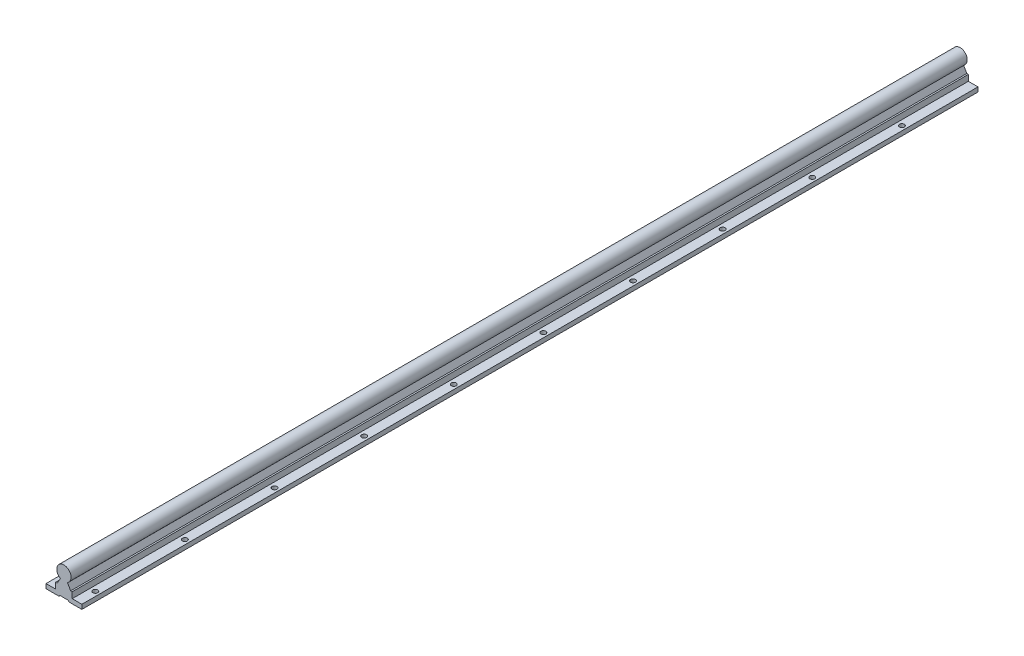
ISO-10303-21;
HEADER;
FILE_DESCRIPTION(('STEP AP214'),'2;1');
FILE_NAME('part.step','',(''),(''),'','','');
FILE_SCHEMA(('AUTOMOTIVE_DESIGN { 1 0 10303 214 1 1 1 1 }'));
ENDSEC;
DATA;
#1=APPLICATION_CONTEXT('core data for automotive mechanical design processes');
#2=APPLICATION_PROTOCOL_DEFINITION('international standard','automotive_design',2000,#1);
#3=PRODUCT_CONTEXT('',#1,'mechanical');
#4=PRODUCT('Part','Part','',(#3));
#5=PRODUCT_RELATED_PRODUCT_CATEGORY('part','',(#4));
#6=PRODUCT_DEFINITION_FORMATION('','',#4);
#7=PRODUCT_DEFINITION_CONTEXT('part definition',#1,'design');
#8=PRODUCT_DEFINITION('design','',#6,#7);
#9=PRODUCT_DEFINITION_SHAPE('','',#8);
#10=(LENGTH_UNIT() NAMED_UNIT(*) SI_UNIT(.MILLI.,.METRE.));
#11=(NAMED_UNIT(*) PLANE_ANGLE_UNIT() SI_UNIT($,.RADIAN.));
#12=(NAMED_UNIT(*) SI_UNIT($,.STERADIAN.) SOLID_ANGLE_UNIT());
#13=UNCERTAINTY_MEASURE_WITH_UNIT(LENGTH_MEASURE(1.E-05),#10,'distance_accuracy_value','');
#14=(GEOMETRIC_REPRESENTATION_CONTEXT(3) GLOBAL_UNCERTAINTY_ASSIGNED_CONTEXT((#13)) GLOBAL_UNIT_ASSIGNED_CONTEXT((#10,
#11,#12)) REPRESENTATION_CONTEXT('',''));
#15=CARTESIAN_POINT('',(0.,0.,0.));
#16=DIRECTION('',(0.,0.,1.));
#17=DIRECTION('',(1.,0.,0.));
#18=AXIS2_PLACEMENT_3D('',#15,#16,#17);
#19=CARTESIAN_POINT('',(-9.25,-11.5,1000.));
#20=DIRECTION('',(0.,-1.,0.));
#21=DIRECTION('',(0.,0.,-1.));
#22=AXIS2_PLACEMENT_3D('',#19,#20,#21);
#23=PLANE('',#22);
#24=CARTESIAN_POINT('',(-15.,-11.5,79.9479983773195));
#25=DIRECTION('',(0.,1.,0.));
#26=DIRECTION('',(0.,0.,1.));
#27=AXIS2_PLACEMENT_3D('',#24,#25,#26);
#28=CIRCLE('',#27,2.75);
#29=CARTESIAN_POINT('',(-15.,-11.5,82.6979983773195));
#30=VERTEX_POINT('',#29);
#31=EDGE_CURVE('E648',#30,#30,#28,.T.);
#32=ORIENTED_EDGE('',*,*,#31,.F.);
#33=EDGE_LOOP('',(#32));
#34=FACE_BOUND('',#33,.T.);
#35=CARTESIAN_POINT('',(-15.,-11.5,379.965332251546));
#36=DIRECTION('',(0.,1.,0.));
#37=DIRECTION('',(0.,0.,1.));
#38=AXIS2_PLACEMENT_3D('',#35,#36,#37);
#39=CIRCLE('',#38,2.75);
#40=CARTESIAN_POINT('',(-15.,-11.5,382.715332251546));
#41=VERTEX_POINT('',#40);
#42=EDGE_CURVE('E624',#41,#41,#39,.T.);
#43=ORIENTED_EDGE('',*,*,#42,.F.);
#44=EDGE_LOOP('',(#43));
#45=FACE_BOUND('',#44,.T.);
#46=CARTESIAN_POINT('',(-15.,-11.5,579.976888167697));
#47=DIRECTION('',(0.,1.,0.));
#48=DIRECTION('',(0.,0.,1.));
#49=AXIS2_PLACEMENT_3D('',#46,#47,#48);
#50=CIRCLE('',#49,2.75);
#51=CARTESIAN_POINT('',(-15.,-11.5,582.726888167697));
#52=VERTEX_POINT('',#51);
#53=EDGE_CURVE('E608',#52,#52,#50,.T.);
#54=ORIENTED_EDGE('',*,*,#53,.F.);
#55=EDGE_LOOP('',(#54));
#56=FACE_BOUND('',#55,.T.);
#57=CARTESIAN_POINT('',(-15.,-11.5,679.982666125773));
#58=DIRECTION('',(0.,1.,0.));
#59=DIRECTION('',(0.,0.,1.));
#60=AXIS2_PLACEMENT_3D('',#57,#58,#59);
#61=CIRCLE('',#60,2.75);
#62=CARTESIAN_POINT('',(-15.,-11.5,682.732666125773));
#63=VERTEX_POINT('',#62);
#64=EDGE_CURVE('E600',#63,#63,#61,.T.);
#65=ORIENTED_EDGE('',*,*,#64,.F.);
#66=EDGE_LOOP('',(#65));
#67=FACE_BOUND('',#66,.T.);
#68=CARTESIAN_POINT('',(-15.,-11.5,779.988444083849));
#69=DIRECTION('',(0.,1.,0.));
#70=DIRECTION('',(0.,0.,1.));
#71=AXIS2_PLACEMENT_3D('',#68,#69,#70);
#72=CIRCLE('',#71,2.75);
#73=CARTESIAN_POINT('',(-15.,-11.5,782.738444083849));
#74=VERTEX_POINT('',#73);
#75=EDGE_CURVE('E592',#74,#74,#72,.T.);
#76=ORIENTED_EDGE('',*,*,#75,.F.);
#77=EDGE_LOOP('',(#76));
#78=FACE_BOUND('',#77,.T.);
#79=CARTESIAN_POINT('',(-15.,-11.5,879.994222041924));
#80=DIRECTION('',(0.,1.,0.));
#81=DIRECTION('',(0.,0.,1.));
#82=AXIS2_PLACEMENT_3D('',#79,#80,#81);
#83=CIRCLE('',#82,2.75);
#84=CARTESIAN_POINT('',(-15.,-11.5,882.744222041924));
#85=VERTEX_POINT('',#84);
#86=EDGE_CURVE('E584',#85,#85,#83,.T.);
#87=ORIENTED_EDGE('',*,*,#86,.F.);
#88=EDGE_LOOP('',(#87));
#89=FACE_BOUND('',#88,.T.);
#90=CARTESIAN_POINT('',(-15.,-11.5,980.));
#91=DIRECTION('',(0.,1.,0.));
#92=DIRECTION('',(0.,0.,1.));
#93=AXIS2_PLACEMENT_3D('',#90,#91,#92);
#94=CIRCLE('',#93,2.75);
#95=CARTESIAN_POINT('',(-15.,-11.5,982.75));
#96=VERTEX_POINT('',#95);
#97=EDGE_CURVE('E522',#96,#96,#94,.T.);
#98=ORIENTED_EDGE('',*,*,#97,.F.);
#99=EDGE_LOOP('',(#98));
#100=FACE_BOUND('',#99,.T.);
#101=DIRECTION('',(-1.,0.,0.));
#102=VECTOR('',#101,1.);
#103=CARTESIAN_POINT('',(-9.25,-11.5,0.));
#104=LINE('',#103,#102);
#105=CARTESIAN_POINT('',(-9.25,-11.5,0.));
#106=VERTEX_POINT('',#105);
#107=CARTESIAN_POINT('',(-20.,-11.5,0.));
#108=VERTEX_POINT('',#107);
#109=EDGE_CURVE('E264',#106,#108,#104,.T.);
#110=ORIENTED_EDGE('',*,*,#109,.T.);
#111=DIRECTION('',(0.,0.,-1.));
#112=VECTOR('',#111,1.);
#113=CARTESIAN_POINT('',(-20.,-11.5,1000.));
#114=LINE('',#113,#112);
#115=CARTESIAN_POINT('',(-20.,-11.5,1000.));
#116=VERTEX_POINT('',#115);
#117=EDGE_CURVE('E290',#116,#108,#114,.T.);
#118=ORIENTED_EDGE('',*,*,#117,.F.);
#119=DIRECTION('',(-1.,0.,0.));
#120=VECTOR('',#119,1.);
#121=CARTESIAN_POINT('',(-9.25,-11.5,1000.));
#122=LINE('',#121,#120);
#123=CARTESIAN_POINT('',(-9.25,-11.5,1000.));
#124=VERTEX_POINT('',#123);
#125=EDGE_CURVE('E386',#124,#116,#122,.T.);
#126=ORIENTED_EDGE('',*,*,#125,.F.);
#127=DIRECTION('',(0.,0.,-1.));
#128=VECTOR('',#127,1.);
#129=CARTESIAN_POINT('',(-9.25,-11.5,1000.));
#130=LINE('',#129,#128);
#131=EDGE_CURVE('E294',#124,#106,#130,.T.);
#132=ORIENTED_EDGE('',*,*,#131,.T.);
#133=EDGE_LOOP('',(#110,#118,#126,#132));
#134=FACE_BOUND('',#133,.T.);
#135=CARTESIAN_POINT('',(-15.,-11.5,479.971110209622));
#136=DIRECTION('',(0.,1.,0.));
#137=DIRECTION('',(0.,0.,1.));
#138=AXIS2_PLACEMENT_3D('',#135,#136,#137);
#139=CIRCLE('',#138,2.75);
#140=CARTESIAN_POINT('',(-15.,-11.5,482.721110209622));
#141=VERTEX_POINT('',#140);
#142=EDGE_CURVE('E616',#141,#141,#139,.T.);
#143=ORIENTED_EDGE('',*,*,#142,.F.);
#144=EDGE_LOOP('',(#143));
#145=FACE_BOUND('',#144,.T.);
#146=CARTESIAN_POINT('',(-15.,-11.5,279.959554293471));
#147=DIRECTION('',(0.,1.,0.));
#148=DIRECTION('',(0.,0.,1.));
#149=AXIS2_PLACEMENT_3D('',#146,#147,#148);
#150=CIRCLE('',#149,2.75);
#151=CARTESIAN_POINT('',(-15.,-11.5,282.709554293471));
#152=VERTEX_POINT('',#151);
#153=EDGE_CURVE('E632',#152,#152,#150,.T.);
#154=ORIENTED_EDGE('',*,*,#153,.F.);
#155=EDGE_LOOP('',(#154));
#156=FACE_BOUND('',#155,.T.);
#157=CARTESIAN_POINT('',(-15.,-11.5,179.953776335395));
#158=DIRECTION('',(0.,1.,0.));
#159=DIRECTION('',(0.,0.,1.));
#160=AXIS2_PLACEMENT_3D('',#157,#158,#159);
#161=CIRCLE('',#160,2.75);
#162=CARTESIAN_POINT('',(-15.,-11.5,182.703776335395));
#163=VERTEX_POINT('',#162);
#164=EDGE_CURVE('E640',#163,#163,#161,.T.);
#165=ORIENTED_EDGE('',*,*,#164,.F.);
#166=EDGE_LOOP('',(#165));
#167=FACE_BOUND('',#166,.T.);
#168=ADVANCED_FACE('F64',(#34,#45,#56,#67,#78,#89,#100,#134,#145,#156,#167),#23,.F.);
#169=CARTESIAN_POINT('',(20.,-11.5,1000.));
#170=DIRECTION('',(0.,-1.,0.));
#171=DIRECTION('',(1.,0.,0.));
#172=AXIS2_PLACEMENT_3D('',#169,#170,#171);
#173=PLANE('',#172);
#174=CARTESIAN_POINT('',(15.,-11.5,79.9479983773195));
#175=DIRECTION('',(0.,1.,0.));
#176=DIRECTION('',(0.,0.,1.));
#177=AXIS2_PLACEMENT_3D('',#174,#175,#176);
#178=CIRCLE('',#177,2.75);
#179=CARTESIAN_POINT('',(15.,-11.5,82.6979983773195));
#180=VERTEX_POINT('',#179);
#181=EDGE_CURVE('E576',#180,#180,#178,.T.);
#182=ORIENTED_EDGE('',*,*,#181,.F.);
#183=EDGE_LOOP('',(#182));
#184=FACE_BOUND('',#183,.T.);
#185=CARTESIAN_POINT('',(15.,-11.5,179.953776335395));
#186=DIRECTION('',(0.,1.,0.));
#187=DIRECTION('',(0.,0.,1.));
#188=AXIS2_PLACEMENT_3D('',#185,#186,#187);
#189=CIRCLE('',#188,2.75);
#190=CARTESIAN_POINT('',(15.,-11.5,182.703776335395));
#191=VERTEX_POINT('',#190);
#192=EDGE_CURVE('E570',#191,#191,#189,.T.);
#193=ORIENTED_EDGE('',*,*,#192,.F.);
#194=EDGE_LOOP('',(#193));
#195=FACE_BOUND('',#194,.T.);
#196=CARTESIAN_POINT('',(15.,-11.5,279.959554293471));
#197=DIRECTION('',(0.,1.,0.));
#198=DIRECTION('',(0.,0.,1.));
#199=AXIS2_PLACEMENT_3D('',#196,#197,#198);
#200=CIRCLE('',#199,2.75);
#201=CARTESIAN_POINT('',(15.,-11.5,282.709554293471));
#202=VERTEX_POINT('',#201);
#203=EDGE_CURVE('E564',#202,#202,#200,.T.);
#204=ORIENTED_EDGE('',*,*,#203,.F.);
#205=EDGE_LOOP('',(#204));
#206=FACE_BOUND('',#205,.T.);
#207=CARTESIAN_POINT('',(15.,-11.5,379.965332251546));
#208=DIRECTION('',(0.,1.,0.));
#209=DIRECTION('',(0.,0.,1.));
#210=AXIS2_PLACEMENT_3D('',#207,#208,#209);
#211=CIRCLE('',#210,2.75);
#212=CARTESIAN_POINT('',(15.,-11.5,382.715332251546));
#213=VERTEX_POINT('',#212);
#214=EDGE_CURVE('E558',#213,#213,#211,.T.);
#215=ORIENTED_EDGE('',*,*,#214,.F.);
#216=EDGE_LOOP('',(#215));
#217=FACE_BOUND('',#216,.T.);
#218=CARTESIAN_POINT('',(15.,-11.5,579.976888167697));
#219=DIRECTION('',(0.,1.,0.));
#220=DIRECTION('',(0.,0.,1.));
#221=AXIS2_PLACEMENT_3D('',#218,#219,#220);
#222=CIRCLE('',#221,2.75);
#223=CARTESIAN_POINT('',(15.,-11.5,582.726888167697));
#224=VERTEX_POINT('',#223);
#225=EDGE_CURVE('E546',#224,#224,#222,.T.);
#226=ORIENTED_EDGE('',*,*,#225,.F.);
#227=EDGE_LOOP('',(#226));
#228=FACE_BOUND('',#227,.T.);
#229=CARTESIAN_POINT('',(15.,-11.5,679.982666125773));
#230=DIRECTION('',(0.,1.,0.));
#231=DIRECTION('',(0.,0.,1.));
#232=AXIS2_PLACEMENT_3D('',#229,#230,#231);
#233=CIRCLE('',#232,2.75);
#234=CARTESIAN_POINT('',(15.,-11.5,682.732666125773));
#235=VERTEX_POINT('',#234);
#236=EDGE_CURVE('E540',#235,#235,#233,.T.);
#237=ORIENTED_EDGE('',*,*,#236,.F.);
#238=EDGE_LOOP('',(#237));
#239=FACE_BOUND('',#238,.T.);
#240=CARTESIAN_POINT('',(15.,-11.5,779.988444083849));
#241=DIRECTION('',(0.,1.,0.));
#242=DIRECTION('',(0.,0.,1.));
#243=AXIS2_PLACEMENT_3D('',#240,#241,#242);
#244=CIRCLE('',#243,2.75);
#245=CARTESIAN_POINT('',(15.,-11.5,782.738444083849));
#246=VERTEX_POINT('',#245);
#247=EDGE_CURVE('E534',#246,#246,#244,.T.);
#248=ORIENTED_EDGE('',*,*,#247,.F.);
#249=EDGE_LOOP('',(#248));
#250=FACE_BOUND('',#249,.T.);
#251=CARTESIAN_POINT('',(15.,-11.5,980.));
#252=DIRECTION('',(0.,1.,0.));
#253=DIRECTION('',(0.,0.,1.));
#254=AXIS2_PLACEMENT_3D('',#251,#252,#253);
#255=CIRCLE('',#254,2.75);
#256=CARTESIAN_POINT('',(15.,-11.5,982.75));
#257=VERTEX_POINT('',#256);
#258=EDGE_CURVE('E507',#257,#257,#255,.T.);
#259=ORIENTED_EDGE('',*,*,#258,.F.);
#260=EDGE_LOOP('',(#259));
#261=FACE_BOUND('',#260,.T.);
#262=DIRECTION('',(-1.,0.,0.));
#263=VECTOR('',#262,1.);
#264=CARTESIAN_POINT('',(20.,-11.5,0.));
#265=LINE('',#264,#263);
#266=CARTESIAN_POINT('',(20.,-11.5,0.));
#267=VERTEX_POINT('',#266);
#268=CARTESIAN_POINT('',(9.25,-11.5,0.));
#269=VERTEX_POINT('',#268);
#270=EDGE_CURVE('E234',#267,#269,#265,.T.);
#271=ORIENTED_EDGE('',*,*,#270,.T.);
#272=DIRECTION('',(0.,0.,-1.));
#273=VECTOR('',#272,1.);
#274=CARTESIAN_POINT('',(9.25,-11.5,1000.));
#275=LINE('',#274,#273);
#276=CARTESIAN_POINT('',(9.25,-11.5,1000.));
#277=VERTEX_POINT('',#276);
#278=EDGE_CURVE('E330',#277,#269,#275,.T.);
#279=ORIENTED_EDGE('',*,*,#278,.F.);
#280=DIRECTION('',(-1.,0.,0.));
#281=VECTOR('',#280,1.);
#282=CARTESIAN_POINT('',(20.,-11.5,1000.));
#283=LINE('',#282,#281);
#284=CARTESIAN_POINT('',(20.,-11.5,1000.));
#285=VERTEX_POINT('',#284);
#286=EDGE_CURVE('E341',#285,#277,#283,.T.);
#287=ORIENTED_EDGE('',*,*,#286,.F.);
#288=DIRECTION('',(0.,0.,-1.));
#289=VECTOR('',#288,1.);
#290=CARTESIAN_POINT('',(20.,-11.5,1000.));
#291=LINE('',#290,#289);
#292=EDGE_CURVE('E74',#285,#267,#291,.T.);
#293=ORIENTED_EDGE('',*,*,#292,.T.);
#294=EDGE_LOOP('',(#271,#279,#287,#293));
#295=FACE_BOUND('',#294,.T.);
#296=CARTESIAN_POINT('',(15.,-11.5,879.994222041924));
#297=DIRECTION('',(0.,1.,0.));
#298=DIRECTION('',(0.,0.,1.));
#299=AXIS2_PLACEMENT_3D('',#296,#297,#298);
#300=CIRCLE('',#299,2.75);
#301=CARTESIAN_POINT('',(15.,-11.5,882.744222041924));
#302=VERTEX_POINT('',#301);
#303=EDGE_CURVE('E528',#302,#302,#300,.T.);
#304=ORIENTED_EDGE('',*,*,#303,.F.);
#305=EDGE_LOOP('',(#304));
#306=FACE_BOUND('',#305,.T.);
#307=CARTESIAN_POINT('',(15.,-11.5,479.971110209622));
#308=DIRECTION('',(0.,1.,0.));
#309=DIRECTION('',(0.,0.,1.));
#310=AXIS2_PLACEMENT_3D('',#307,#308,#309);
#311=CIRCLE('',#310,2.75);
#312=CARTESIAN_POINT('',(15.,-11.5,482.721110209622));
#313=VERTEX_POINT('',#312);
#314=EDGE_CURVE('E552',#313,#313,#311,.T.);
#315=ORIENTED_EDGE('',*,*,#314,.F.);
#316=EDGE_LOOP('',(#315));
#317=FACE_BOUND('',#316,.T.);
#318=ADVANCED_FACE('F338',(#184,#195,#206,#217,#228,#239,#250,#261,#295,#306,#317),#173,.F.);
#319=CARTESIAN_POINT('',(5.47168783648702,-16.5,1000.));
#320=DIRECTION('',(0.,1.,0.));
#321=DIRECTION('',(-1.,0.,0.));
#322=AXIS2_PLACEMENT_3D('',#319,#320,#321);
#323=PLANE('',#322);
#324=CARTESIAN_POINT('',(15.,-16.5,79.9479983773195));
#325=DIRECTION('',(0.,1.,0.));
#326=DIRECTION('',(0.,0.,1.));
#327=AXIS2_PLACEMENT_3D('',#324,#325,#326);
#328=CIRCLE('',#327,2.75);
#329=CARTESIAN_POINT('',(15.,-16.5,82.6979983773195));
#330=VERTEX_POINT('',#329);
#331=EDGE_CURVE('E470',#330,#330,#328,.T.);
#332=ORIENTED_EDGE('',*,*,#331,.T.);
#333=EDGE_LOOP('',(#332));
#334=FACE_BOUND('',#333,.T.);
#335=CARTESIAN_POINT('',(15.,-16.5,179.953776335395));
#336=DIRECTION('',(0.,1.,0.));
#337=DIRECTION('',(0.,0.,1.));
#338=AXIS2_PLACEMENT_3D('',#335,#336,#337);
#339=CIRCLE('',#338,2.75);
#340=CARTESIAN_POINT('',(15.,-16.5,182.703776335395));
#341=VERTEX_POINT('',#340);
#342=EDGE_CURVE('E474',#341,#341,#339,.T.);
#343=ORIENTED_EDGE('',*,*,#342,.T.);
#344=EDGE_LOOP('',(#343));
#345=FACE_BOUND('',#344,.T.);
#346=CARTESIAN_POINT('',(15.,-16.5,279.959554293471));
#347=DIRECTION('',(0.,1.,0.));
#348=DIRECTION('',(0.,0.,1.));
#349=AXIS2_PLACEMENT_3D('',#346,#347,#348);
#350=CIRCLE('',#349,2.75);
#351=CARTESIAN_POINT('',(15.,-16.5,282.709554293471));
#352=VERTEX_POINT('',#351);
#353=EDGE_CURVE('E478',#352,#352,#350,.T.);
#354=ORIENTED_EDGE('',*,*,#353,.T.);
#355=EDGE_LOOP('',(#354));
#356=FACE_BOUND('',#355,.T.);
#357=CARTESIAN_POINT('',(15.,-16.5,379.965332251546));
#358=DIRECTION('',(0.,1.,0.));
#359=DIRECTION('',(0.,0.,1.));
#360=AXIS2_PLACEMENT_3D('',#357,#358,#359);
#361=CIRCLE('',#360,2.75);
#362=CARTESIAN_POINT('',(15.,-16.5,382.715332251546));
#363=VERTEX_POINT('',#362);
#364=EDGE_CURVE('E482',#363,#363,#361,.T.);
#365=ORIENTED_EDGE('',*,*,#364,.T.);
#366=EDGE_LOOP('',(#365));
#367=FACE_BOUND('',#366,.T.);
#368=CARTESIAN_POINT('',(15.,-16.5,479.971110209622));
#369=DIRECTION('',(0.,1.,0.));
#370=DIRECTION('',(0.,0.,1.));
#371=AXIS2_PLACEMENT_3D('',#368,#369,#370);
#372=CIRCLE('',#371,2.75);
#373=CARTESIAN_POINT('',(15.,-16.5,482.721110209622));
#374=VERTEX_POINT('',#373);
#375=EDGE_CURVE('E486',#374,#374,#372,.T.);
#376=ORIENTED_EDGE('',*,*,#375,.T.);
#377=EDGE_LOOP('',(#376));
#378=FACE_BOUND('',#377,.T.);
#379=CARTESIAN_POINT('',(15.,-16.5,579.976888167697));
#380=DIRECTION('',(0.,1.,0.));
#381=DIRECTION('',(0.,0.,1.));
#382=AXIS2_PLACEMENT_3D('',#379,#380,#381);
#383=CIRCLE('',#382,2.75);
#384=CARTESIAN_POINT('',(15.,-16.5,582.726888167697));
#385=VERTEX_POINT('',#384);
#386=EDGE_CURVE('E490',#385,#385,#383,.T.);
#387=ORIENTED_EDGE('',*,*,#386,.T.);
#388=EDGE_LOOP('',(#387));
#389=FACE_BOUND('',#388,.T.);
#390=CARTESIAN_POINT('',(15.,-16.5,679.982666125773));
#391=DIRECTION('',(0.,1.,0.));
#392=DIRECTION('',(0.,0.,1.));
#393=AXIS2_PLACEMENT_3D('',#390,#391,#392);
#394=CIRCLE('',#393,2.75);
#395=CARTESIAN_POINT('',(15.,-16.5,682.732666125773));
#396=VERTEX_POINT('',#395);
#397=EDGE_CURVE('E494',#396,#396,#394,.T.);
#398=ORIENTED_EDGE('',*,*,#397,.T.);
#399=EDGE_LOOP('',(#398));
#400=FACE_BOUND('',#399,.T.);
#401=CARTESIAN_POINT('',(15.,-16.5,779.988444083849));
#402=DIRECTION('',(0.,1.,0.));
#403=DIRECTION('',(0.,0.,1.));
#404=AXIS2_PLACEMENT_3D('',#401,#402,#403);
#405=CIRCLE('',#404,2.75);
#406=CARTESIAN_POINT('',(15.,-16.5,782.738444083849));
#407=VERTEX_POINT('',#406);
#408=EDGE_CURVE('E498',#407,#407,#405,.T.);
#409=ORIENTED_EDGE('',*,*,#408,.T.);
#410=EDGE_LOOP('',(#409));
#411=FACE_BOUND('',#410,.T.);
#412=CARTESIAN_POINT('',(15.,-16.5,879.994222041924));
#413=DIRECTION('',(0.,1.,0.));
#414=DIRECTION('',(0.,0.,1.));
#415=AXIS2_PLACEMENT_3D('',#412,#413,#414);
#416=CIRCLE('',#415,2.75);
#417=CARTESIAN_POINT('',(15.,-16.5,882.744222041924));
#418=VERTEX_POINT('',#417);
#419=EDGE_CURVE('E502',#418,#418,#416,.T.);
#420=ORIENTED_EDGE('',*,*,#419,.T.);
#421=EDGE_LOOP('',(#420));
#422=FACE_BOUND('',#421,.T.);
#423=CARTESIAN_POINT('',(15.,-16.5,980.));
#424=DIRECTION('',(0.,1.,0.));
#425=DIRECTION('',(0.,0.,1.));
#426=AXIS2_PLACEMENT_3D('',#423,#424,#425);
#427=CIRCLE('',#426,2.75);
#428=CARTESIAN_POINT('',(15.,-16.5,982.75));
#429=VERTEX_POINT('',#428);
#430=EDGE_CURVE('E231',#429,#429,#427,.T.);
#431=ORIENTED_EDGE('',*,*,#430,.T.);
#432=EDGE_LOOP('',(#431));
#433=FACE_BOUND('',#432,.T.);
#434=DIRECTION('',(1.,0.,0.));
#435=VECTOR('',#434,1.);
#436=CARTESIAN_POINT('',(5.47168783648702,-16.5,0.));
#437=LINE('',#436,#435);
#438=CARTESIAN_POINT('',(5.47168783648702,-16.5,0.));
#439=VERTEX_POINT('',#438);
#440=CARTESIAN_POINT('',(20.,-16.5,0.));
#441=VERTEX_POINT('',#440);
#442=EDGE_CURVE('E226',#439,#441,#437,.T.);
#443=ORIENTED_EDGE('',*,*,#442,.T.);
#444=DIRECTION('',(0.,0.,-1.));
#445=VECTOR('',#444,1.);
#446=CARTESIAN_POINT('',(20.,-16.5,1000.));
#447=LINE('',#446,#445);
#448=CARTESIAN_POINT('',(20.,-16.5,1000.));
#449=VERTEX_POINT('',#448);
#450=EDGE_CURVE('E12',#449,#441,#447,.T.);
#451=ORIENTED_EDGE('',*,*,#450,.F.);
#452=DIRECTION('',(1.,0.,0.));
#453=VECTOR('',#452,1.);
#454=CARTESIAN_POINT('',(5.47168783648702,-16.5,1000.));
#455=LINE('',#454,#453);
#456=CARTESIAN_POINT('',(5.47168783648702,-16.5,1000.));
#457=VERTEX_POINT('',#456);
#458=EDGE_CURVE('E279',#457,#449,#455,.T.);
#459=ORIENTED_EDGE('',*,*,#458,.F.);
#460=DIRECTION('',(0.,0.,-1.));
#461=VECTOR('',#460,1.);
#462=CARTESIAN_POINT('',(5.47168783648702,-16.5,1000.));
#463=LINE('',#462,#461);
#464=EDGE_CURVE('E222',#457,#439,#463,.T.);
#465=ORIENTED_EDGE('',*,*,#464,.T.);
#466=EDGE_LOOP('',(#443,#451,#459,#465));
#467=FACE_BOUND('',#466,.T.);
#468=ADVANCED_FACE('F66',(#334,#345,#356,#367,#378,#389,#400,#411,#422,#433,#467),#323,.F.);
#469=CARTESIAN_POINT('',(20.,-16.5,1000.));
#470=DIRECTION('',(-1.,0.,0.));
#471=DIRECTION('',(0.,0.,1.));
#472=AXIS2_PLACEMENT_3D('',#469,#470,#471);
#473=PLANE('',#472);
#474=DIRECTION('',(0.,1.,0.));
#475=VECTOR('',#474,1.);
#476=CARTESIAN_POINT('',(20.,-16.5,0.));
#477=LINE('',#476,#475);
#478=EDGE_CURVE('E230',#441,#267,#477,.T.);
#479=ORIENTED_EDGE('',*,*,#478,.T.);
#480=ORIENTED_EDGE('',*,*,#292,.F.);
#481=DIRECTION('',(0.,1.,0.));
#482=VECTOR('',#481,1.);
#483=CARTESIAN_POINT('',(20.,-16.5,1000.));
#484=LINE('',#483,#482);
#485=EDGE_CURVE('E155',#449,#285,#484,.T.);
#486=ORIENTED_EDGE('',*,*,#485,.F.);
#487=ORIENTED_EDGE('',*,*,#450,.T.);
#488=EDGE_LOOP('',(#479,#480,#486,#487));
#489=FACE_BOUND('',#488,.T.);
#490=ADVANCED_FACE('F459',(#489),#473,.F.);
#491=CARTESIAN_POINT('',(9.25,-11.5,1000.));
#492=DIRECTION('',(-1.,0.,0.));
#493=DIRECTION('',(0.,0.,1.));
#494=AXIS2_PLACEMENT_3D('',#491,#492,#493);
#495=PLANE('',#494);
#496=DIRECTION('',(0.,1.,0.));
#497=VECTOR('',#496,1.);
#498=CARTESIAN_POINT('',(9.25,-11.5,0.));
#499=LINE('',#498,#497);
#500=CARTESIAN_POINT('',(9.25,-4.8,0.));
#501=VERTEX_POINT('',#500);
#502=EDGE_CURVE('E237',#269,#501,#499,.T.);
#503=ORIENTED_EDGE('',*,*,#502,.T.);
#504=DIRECTION('',(0.,0.,-1.));
#505=VECTOR('',#504,1.);
#506=CARTESIAN_POINT('',(9.25,-4.8,1000.));
#507=LINE('',#506,#505);
#508=CARTESIAN_POINT('',(9.25,-4.8,1000.));
#509=VERTEX_POINT('',#508);
#510=EDGE_CURVE('E326',#509,#501,#507,.T.);
#511=ORIENTED_EDGE('',*,*,#510,.F.);
#512=DIRECTION('',(0.,1.,0.));
#513=VECTOR('',#512,1.);
#514=CARTESIAN_POINT('',(9.25,-11.5,1000.));
#515=LINE('',#514,#513);
#516=EDGE_CURVE('E360',#277,#509,#515,.T.);
#517=ORIENTED_EDGE('',*,*,#516,.F.);
#518=ORIENTED_EDGE('',*,*,#278,.T.);
#519=EDGE_LOOP('',(#503,#511,#517,#518));
#520=FACE_BOUND('',#519,.T.);
#521=ADVANCED_FACE('F350',(#520),#495,.F.);
#522=CARTESIAN_POINT('',(9.25,-4.8,1000.));
#523=DIRECTION('',(0.,-1.,0.));
#524=DIRECTION('',(1.,0.,0.));
#525=AXIS2_PLACEMENT_3D('',#522,#523,#524);
#526=PLANE('',#525);
#527=DIRECTION('',(-1.,0.,0.));
#528=VECTOR('',#527,1.);
#529=CARTESIAN_POINT('',(9.25,-4.8,0.));
#530=LINE('',#529,#528);
#531=CARTESIAN_POINT('',(7.5218366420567,-4.80000000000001,0.));
#532=VERTEX_POINT('',#531);
#533=EDGE_CURVE('E240',#501,#532,#530,.T.);
#534=ORIENTED_EDGE('',*,*,#533,.T.);
#535=DIRECTION('',(0.,0.,-1.));
#536=VECTOR('',#535,1.);
#537=CARTESIAN_POINT('',(7.5218366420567,-4.80000000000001,1000.));
#538=LINE('',#537,#536);
#539=CARTESIAN_POINT('',(7.5218366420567,-4.80000000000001,1000.));
#540=VERTEX_POINT('',#539);
#541=EDGE_CURVE('E322',#540,#532,#538,.T.);
#542=ORIENTED_EDGE('',*,*,#541,.F.);
#543=DIRECTION('',(-1.,0.,0.));
#544=VECTOR('',#543,1.);
#545=CARTESIAN_POINT('',(9.25,-4.8,1000.));
#546=LINE('',#545,#544);
#547=EDGE_CURVE('E356',#509,#540,#546,.T.);
#548=ORIENTED_EDGE('',*,*,#547,.F.);
#549=ORIENTED_EDGE('',*,*,#510,.T.);
#550=EDGE_LOOP('',(#534,#542,#548,#549));
#551=FACE_BOUND('',#550,.T.);
#552=ADVANCED_FACE('F354',(#551),#526,.F.);
#553=CARTESIAN_POINT('',(7.5218366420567,-4.80000000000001,1000.));
#554=DIRECTION('',(-0.86602540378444,-0.499999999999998,0.));
#555=DIRECTION('',(0.499999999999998,-0.86602540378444,0.));
#556=AXIS2_PLACEMENT_3D('',#553,#554,#555);
#557=PLANE('',#556);
#558=DIRECTION('',(-0.499999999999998,0.86602540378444,0.));
#559=VECTOR('',#558,1.);
#560=CARTESIAN_POINT('',(7.5218366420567,-4.80000000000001,0.));
#561=LINE('',#560,#559);
#562=CARTESIAN_POINT('',(4.,1.3,0.));
#563=VERTEX_POINT('',#562);
#564=EDGE_CURVE('E243',#532,#563,#561,.T.);
#565=ORIENTED_EDGE('',*,*,#564,.T.);
#566=DIRECTION('',(0.,0.,-1.));
#567=VECTOR('',#566,1.);
#568=CARTESIAN_POINT('',(4.,1.3,1000.));
#569=LINE('',#568,#567);
#570=CARTESIAN_POINT('',(4.,1.3,1000.));
#571=VERTEX_POINT('',#570);
#572=EDGE_CURVE('E318',#571,#563,#569,.T.);
#573=ORIENTED_EDGE('',*,*,#572,.F.);
#574=DIRECTION('',(-0.499999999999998,0.86602540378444,0.));
#575=VECTOR('',#574,1.);
#576=CARTESIAN_POINT('',(7.5218366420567,-4.80000000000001,1000.));
#577=LINE('',#576,#575);
#578=EDGE_CURVE('E359',#540,#571,#577,.T.);
#579=ORIENTED_EDGE('',*,*,#578,.F.);
#580=ORIENTED_EDGE('',*,*,#541,.T.);
#581=EDGE_LOOP('',(#565,#573,#579,#580));
#582=FACE_BOUND('',#581,.T.);
#583=ADVANCED_FACE('F451',(#582),#557,.F.);
#584=CARTESIAN_POINT('',(4.,1.3,1000.));
#585=DIRECTION('',(0.,-1.,0.));
#586=DIRECTION('',(1.,0.,0.));
#587=AXIS2_PLACEMENT_3D('',#584,#585,#586);
#588=PLANE('',#587);
#589=DIRECTION('',(-1.,0.,0.));
#590=VECTOR('',#589,1.);
#591=CARTESIAN_POINT('',(4.,1.3,0.));
#592=LINE('',#591,#590);
#593=CARTESIAN_POINT('',(3.48711915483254,1.3,0.));
#594=VERTEX_POINT('',#593);
#595=EDGE_CURVE('E246',#563,#594,#592,.T.);
#596=ORIENTED_EDGE('',*,*,#595,.T.);
#597=DIRECTION('',(0.,0.,-1.));
#598=VECTOR('',#597,1.);
#599=CARTESIAN_POINT('',(3.48711915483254,1.3,1000.));
#600=LINE('',#599,#598);
#601=CARTESIAN_POINT('',(3.48711915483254,1.3,1000.));
#602=VERTEX_POINT('',#601);
#603=EDGE_CURVE('E314',#602,#594,#600,.T.);
#604=ORIENTED_EDGE('',*,*,#603,.F.);
#605=DIRECTION('',(-1.,0.,0.));
#606=VECTOR('',#605,1.);
#607=CARTESIAN_POINT('',(4.,1.3,1000.));
#608=LINE('',#607,#606);
#609=EDGE_CURVE('E364',#571,#602,#608,.T.);
#610=ORIENTED_EDGE('',*,*,#609,.F.);
#611=ORIENTED_EDGE('',*,*,#572,.T.);
#612=EDGE_LOOP('',(#596,#604,#610,#611));
#613=FACE_BOUND('',#612,.T.);
#614=ADVANCED_FACE('F447',(#613),#588,.F.);
#615=CARTESIAN_POINT('',(0.,8.5,1000.));
#616=DIRECTION('',(0.,0.,-1.));
#617=DIRECTION('',(-1.,0.,0.));
#618=AXIS2_PLACEMENT_3D('',#615,#616,#617);
#619=CYLINDRICAL_SURFACE('',#618,8.);
#620=CARTESIAN_POINT('',(0.,8.5,0.));
#621=DIRECTION('',(0.,0.,1.));
#622=DIRECTION('',(1.,0.,0.));
#623=AXIS2_PLACEMENT_3D('',#620,#621,#622);
#624=CIRCLE('',#623,8.);
#625=CARTESIAN_POINT('',(-3.48711915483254,1.3,0.));
#626=VERTEX_POINT('',#625);
#627=EDGE_CURVE('E249',#594,#626,#624,.T.);
#628=ORIENTED_EDGE('',*,*,#627,.T.);
#629=DIRECTION('',(0.,0.,-1.));
#630=VECTOR('',#629,1.);
#631=CARTESIAN_POINT('',(-3.48711915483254,1.3,1000.));
#632=LINE('',#631,#630);
#633=CARTESIAN_POINT('',(-3.48711915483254,1.3,1000.));
#634=VERTEX_POINT('',#633);
#635=EDGE_CURVE('E310',#634,#626,#632,.T.);
#636=ORIENTED_EDGE('',*,*,#635,.F.);
#637=CARTESIAN_POINT('',(0.,8.5,1000.));
#638=DIRECTION('',(0.,0.,1.));
#639=DIRECTION('',(1.,0.,0.));
#640=AXIS2_PLACEMENT_3D('',#637,#638,#639);
#641=CIRCLE('',#640,8.);
#642=EDGE_CURVE('E371',#602,#634,#641,.T.);
#643=ORIENTED_EDGE('',*,*,#642,.F.);
#644=ORIENTED_EDGE('',*,*,#603,.T.);
#645=EDGE_LOOP('',(#628,#636,#643,#644));
#646=FACE_BOUND('',#645,.T.);
#647=ADVANCED_FACE('F443',(#646),#619,.T.);
#648=CARTESIAN_POINT('',(-3.48711915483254,1.3,1000.));
#649=DIRECTION('',(0.,-1.,0.));
#650=DIRECTION('',(0.,0.,-1.));
#651=AXIS2_PLACEMENT_3D('',#648,#649,#650);
#652=PLANE('',#651);
#653=DIRECTION('',(-1.,0.,0.));
#654=VECTOR('',#653,1.);
#655=CARTESIAN_POINT('',(-3.48711915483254,1.3,0.));
#656=LINE('',#655,#654);
#657=CARTESIAN_POINT('',(-4.,1.3,0.));
#658=VERTEX_POINT('',#657);
#659=EDGE_CURVE('E252',#626,#658,#656,.T.);
#660=ORIENTED_EDGE('',*,*,#659,.T.);
#661=DIRECTION('',(0.,0.,-1.));
#662=VECTOR('',#661,1.);
#663=CARTESIAN_POINT('',(-4.,1.3,1000.));
#664=LINE('',#663,#662);
#665=CARTESIAN_POINT('',(-4.,1.3,1000.));
#666=VERTEX_POINT('',#665);
#667=EDGE_CURVE('E306',#666,#658,#664,.T.);
#668=ORIENTED_EDGE('',*,*,#667,.F.);
#669=DIRECTION('',(-1.,0.,0.));
#670=VECTOR('',#669,1.);
#671=CARTESIAN_POINT('',(-3.48711915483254,1.3,1000.));
#672=LINE('',#671,#670);
#673=EDGE_CURVE('E374',#634,#666,#672,.T.);
#674=ORIENTED_EDGE('',*,*,#673,.F.);
#675=ORIENTED_EDGE('',*,*,#635,.T.);
#676=EDGE_LOOP('',(#660,#668,#674,#675));
#677=FACE_BOUND('',#676,.T.);
#678=ADVANCED_FACE('F439',(#677),#652,.F.);
#679=CARTESIAN_POINT('',(-4.,1.3,1000.));
#680=DIRECTION('',(0.86602540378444,-0.499999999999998,0.));
#681=DIRECTION('',(0.499999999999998,0.86602540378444,0.));
#682=AXIS2_PLACEMENT_3D('',#679,#680,#681);
#683=PLANE('',#682);
#684=DIRECTION('',(-0.499999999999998,-0.86602540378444,0.));
#685=VECTOR('',#684,1.);
#686=CARTESIAN_POINT('',(-4.,1.3,0.));
#687=LINE('',#686,#685);
#688=CARTESIAN_POINT('',(-7.5218366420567,-4.8,0.));
#689=VERTEX_POINT('',#688);
#690=EDGE_CURVE('E255',#658,#689,#687,.T.);
#691=ORIENTED_EDGE('',*,*,#690,.T.);
#692=DIRECTION('',(0.,0.,-1.));
#693=VECTOR('',#692,1.);
#694=CARTESIAN_POINT('',(-7.5218366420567,-4.8,1000.));
#695=LINE('',#694,#693);
#696=CARTESIAN_POINT('',(-7.5218366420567,-4.8,1000.));
#697=VERTEX_POINT('',#696);
#698=EDGE_CURVE('E302',#697,#689,#695,.T.);
#699=ORIENTED_EDGE('',*,*,#698,.F.);
#700=DIRECTION('',(-0.499999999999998,-0.86602540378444,0.));
#701=VECTOR('',#700,1.);
#702=CARTESIAN_POINT('',(-4.,1.3,1000.));
#703=LINE('',#702,#701);
#704=EDGE_CURVE('E377',#666,#697,#703,.T.);
#705=ORIENTED_EDGE('',*,*,#704,.F.);
#706=ORIENTED_EDGE('',*,*,#667,.T.);
#707=EDGE_LOOP('',(#691,#699,#705,#706));
#708=FACE_BOUND('',#707,.T.);
#709=ADVANCED_FACE('F435',(#708),#683,.F.);
#710=CARTESIAN_POINT('',(-7.5218366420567,-4.8,1000.));
#711=DIRECTION('',(0.,-1.,0.));
#712=DIRECTION('',(0.,0.,-1.));
#713=AXIS2_PLACEMENT_3D('',#710,#711,#712);
#714=PLANE('',#713);
#715=DIRECTION('',(-1.,0.,0.));
#716=VECTOR('',#715,1.);
#717=CARTESIAN_POINT('',(-7.5218366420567,-4.8,0.));
#718=LINE('',#717,#716);
#719=CARTESIAN_POINT('',(-9.25,-4.8,0.));
#720=VERTEX_POINT('',#719);
#721=EDGE_CURVE('E258',#689,#720,#718,.T.);
#722=ORIENTED_EDGE('',*,*,#721,.T.);
#723=DIRECTION('',(0.,0.,-1.));
#724=VECTOR('',#723,1.);
#725=CARTESIAN_POINT('',(-9.25,-4.8,1000.));
#726=LINE('',#725,#724);
#727=CARTESIAN_POINT('',(-9.25,-4.8,1000.));
#728=VERTEX_POINT('',#727);
#729=EDGE_CURVE('E298',#728,#720,#726,.T.);
#730=ORIENTED_EDGE('',*,*,#729,.F.);
#731=DIRECTION('',(-1.,0.,0.));
#732=VECTOR('',#731,1.);
#733=CARTESIAN_POINT('',(-7.5218366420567,-4.8,1000.));
#734=LINE('',#733,#732);
#735=EDGE_CURVE('E380',#697,#728,#734,.T.);
#736=ORIENTED_EDGE('',*,*,#735,.F.);
#737=ORIENTED_EDGE('',*,*,#698,.T.);
#738=EDGE_LOOP('',(#722,#730,#736,#737));
#739=FACE_BOUND('',#738,.T.);
#740=ADVANCED_FACE('F431',(#739),#714,.F.);
#741=CARTESIAN_POINT('',(-9.25,-4.8,1000.));
#742=DIRECTION('',(1.,0.,0.));
#743=DIRECTION('',(0.,0.,-1.));
#744=AXIS2_PLACEMENT_3D('',#741,#742,#743);
#745=PLANE('',#744);
#746=DIRECTION('',(0.,-1.,0.));
#747=VECTOR('',#746,1.);
#748=CARTESIAN_POINT('',(-9.25,-4.8,0.));
#749=LINE('',#748,#747);
#750=EDGE_CURVE('E261',#720,#106,#749,.T.);
#751=ORIENTED_EDGE('',*,*,#750,.T.);
#752=ORIENTED_EDGE('',*,*,#131,.F.);
#753=DIRECTION('',(0.,-1.,0.));
#754=VECTOR('',#753,1.);
#755=CARTESIAN_POINT('',(-9.25,-4.8,1000.));
#756=LINE('',#755,#754);
#757=EDGE_CURVE('E383',#728,#124,#756,.T.);
#758=ORIENTED_EDGE('',*,*,#757,.F.);
#759=ORIENTED_EDGE('',*,*,#729,.T.);
#760=EDGE_LOOP('',(#751,#752,#758,#759));
#761=FACE_BOUND('',#760,.T.);
#762=ADVANCED_FACE('F428',(#761),#745,.F.);
#763=CARTESIAN_POINT('',(-20.,-11.5,1000.));
#764=DIRECTION('',(1.,0.,0.));
#765=DIRECTION('',(0.,0.,-1.));
#766=AXIS2_PLACEMENT_3D('',#763,#764,#765);
#767=PLANE('',#766);
#768=DIRECTION('',(0.,-1.,0.));
#769=VECTOR('',#768,1.);
#770=CARTESIAN_POINT('',(-20.,-11.5,0.));
#771=LINE('',#770,#769);
#772=CARTESIAN_POINT('',(-20.,-16.5,0.));
#773=VERTEX_POINT('',#772);
#774=EDGE_CURVE('E267',#108,#773,#771,.T.);
#775=ORIENTED_EDGE('',*,*,#774,.T.);
#776=DIRECTION('',(0.,0.,-1.));
#777=VECTOR('',#776,1.);
#778=CARTESIAN_POINT('',(-20.,-16.5,1000.));
#779=LINE('',#778,#777);
#780=CARTESIAN_POINT('',(-20.,-16.5,1000.));
#781=VERTEX_POINT('',#780);
#782=EDGE_CURVE('E286',#781,#773,#779,.T.);
#783=ORIENTED_EDGE('',*,*,#782,.F.);
#784=DIRECTION('',(0.,-1.,0.));
#785=VECTOR('',#784,1.);
#786=CARTESIAN_POINT('',(-20.,-11.5,1000.));
#787=LINE('',#786,#785);
#788=EDGE_CURVE('E389',#116,#781,#787,.T.);
#789=ORIENTED_EDGE('',*,*,#788,.F.);
#790=ORIENTED_EDGE('',*,*,#117,.T.);
#791=EDGE_LOOP('',(#775,#783,#789,#790));
#792=FACE_BOUND('',#791,.T.);
#793=ADVANCED_FACE('F397',(#792),#767,.F.);
#794=CARTESIAN_POINT('',(-20.,-16.5,1000.));
#795=DIRECTION('',(0.,1.,0.));
#796=DIRECTION('',(-1.,0.,0.));
#797=AXIS2_PLACEMENT_3D('',#794,#795,#796);
#798=PLANE('',#797);
#799=CARTESIAN_POINT('',(-15.,-16.5,79.9479983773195));
#800=DIRECTION('',(0.,1.,0.));
#801=DIRECTION('',(0.,0.,1.));
#802=AXIS2_PLACEMENT_3D('',#799,#800,#801);
#803=CIRCLE('',#802,2.75);
#804=CARTESIAN_POINT('',(-15.,-16.5,82.6979983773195));
#805=VERTEX_POINT('',#804);
#806=EDGE_CURVE('E644',#805,#805,#803,.T.);
#807=ORIENTED_EDGE('',*,*,#806,.T.);
#808=EDGE_LOOP('',(#807));
#809=FACE_BOUND('',#808,.T.);
#810=CARTESIAN_POINT('',(-15.,-16.5,179.953776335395));
#811=DIRECTION('',(0.,1.,0.));
#812=DIRECTION('',(0.,0.,1.));
#813=AXIS2_PLACEMENT_3D('',#810,#811,#812);
#814=CIRCLE('',#813,2.75);
#815=CARTESIAN_POINT('',(-15.,-16.5,182.703776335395));
#816=VERTEX_POINT('',#815);
#817=EDGE_CURVE('E636',#816,#816,#814,.T.);
#818=ORIENTED_EDGE('',*,*,#817,.T.);
#819=EDGE_LOOP('',(#818));
#820=FACE_BOUND('',#819,.T.);
#821=CARTESIAN_POINT('',(-15.,-16.5,279.959554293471));
#822=DIRECTION('',(0.,1.,0.));
#823=DIRECTION('',(0.,0.,1.));
#824=AXIS2_PLACEMENT_3D('',#821,#822,#823);
#825=CIRCLE('',#824,2.75);
#826=CARTESIAN_POINT('',(-15.,-16.5,282.709554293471));
#827=VERTEX_POINT('',#826);
#828=EDGE_CURVE('E628',#827,#827,#825,.T.);
#829=ORIENTED_EDGE('',*,*,#828,.T.);
#830=EDGE_LOOP('',(#829));
#831=FACE_BOUND('',#830,.T.);
#832=CARTESIAN_POINT('',(-15.,-16.5,379.965332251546));
#833=DIRECTION('',(0.,1.,0.));
#834=DIRECTION('',(0.,0.,1.));
#835=AXIS2_PLACEMENT_3D('',#832,#833,#834);
#836=CIRCLE('',#835,2.75);
#837=CARTESIAN_POINT('',(-15.,-16.5,382.715332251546));
#838=VERTEX_POINT('',#837);
#839=EDGE_CURVE('E620',#838,#838,#836,.T.);
#840=ORIENTED_EDGE('',*,*,#839,.T.);
#841=EDGE_LOOP('',(#840));
#842=FACE_BOUND('',#841,.T.);
#843=CARTESIAN_POINT('',(-15.,-16.5,479.971110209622));
#844=DIRECTION('',(0.,1.,0.));
#845=DIRECTION('',(0.,0.,1.));
#846=AXIS2_PLACEMENT_3D('',#843,#844,#845);
#847=CIRCLE('',#846,2.75);
#848=CARTESIAN_POINT('',(-15.,-16.5,482.721110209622));
#849=VERTEX_POINT('',#848);
#850=EDGE_CURVE('E612',#849,#849,#847,.T.);
#851=ORIENTED_EDGE('',*,*,#850,.T.);
#852=EDGE_LOOP('',(#851));
#853=FACE_BOUND('',#852,.T.);
#854=CARTESIAN_POINT('',(-15.,-16.5,579.976888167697));
#855=DIRECTION('',(0.,1.,0.));
#856=DIRECTION('',(0.,0.,1.));
#857=AXIS2_PLACEMENT_3D('',#854,#855,#856);
#858=CIRCLE('',#857,2.75);
#859=CARTESIAN_POINT('',(-15.,-16.5,582.726888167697));
#860=VERTEX_POINT('',#859);
#861=EDGE_CURVE('E604',#860,#860,#858,.T.);
#862=ORIENTED_EDGE('',*,*,#861,.T.);
#863=EDGE_LOOP('',(#862));
#864=FACE_BOUND('',#863,.T.);
#865=CARTESIAN_POINT('',(-15.,-16.5,679.982666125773));
#866=DIRECTION('',(0.,1.,0.));
#867=DIRECTION('',(0.,0.,1.));
#868=AXIS2_PLACEMENT_3D('',#865,#866,#867);
#869=CIRCLE('',#868,2.75);
#870=CARTESIAN_POINT('',(-15.,-16.5,682.732666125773));
#871=VERTEX_POINT('',#870);
#872=EDGE_CURVE('E596',#871,#871,#869,.T.);
#873=ORIENTED_EDGE('',*,*,#872,.T.);
#874=EDGE_LOOP('',(#873));
#875=FACE_BOUND('',#874,.T.);
#876=CARTESIAN_POINT('',(-15.,-16.5,779.988444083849));
#877=DIRECTION('',(0.,1.,0.));
#878=DIRECTION('',(0.,0.,1.));
#879=AXIS2_PLACEMENT_3D('',#876,#877,#878);
#880=CIRCLE('',#879,2.75);
#881=CARTESIAN_POINT('',(-15.,-16.5,782.738444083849));
#882=VERTEX_POINT('',#881);
#883=EDGE_CURVE('E588',#882,#882,#880,.T.);
#884=ORIENTED_EDGE('',*,*,#883,.T.);
#885=EDGE_LOOP('',(#884));
#886=FACE_BOUND('',#885,.T.);
#887=CARTESIAN_POINT('',(-15.,-16.5,879.994222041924));
#888=DIRECTION('',(0.,1.,0.));
#889=DIRECTION('',(0.,0.,1.));
#890=AXIS2_PLACEMENT_3D('',#887,#888,#889);
#891=CIRCLE('',#890,2.75);
#892=CARTESIAN_POINT('',(-15.,-16.5,882.744222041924));
#893=VERTEX_POINT('',#892);
#894=EDGE_CURVE('E580',#893,#893,#891,.T.);
#895=ORIENTED_EDGE('',*,*,#894,.T.);
#896=EDGE_LOOP('',(#895));
#897=FACE_BOUND('',#896,.T.);
#898=CARTESIAN_POINT('',(-15.,-16.5,980.));
#899=DIRECTION('',(0.,1.,0.));
#900=DIRECTION('',(0.,0.,1.));
#901=AXIS2_PLACEMENT_3D('',#898,#899,#900);
#902=CIRCLE('',#901,2.75);
#903=CARTESIAN_POINT('',(-15.,-16.5,982.75));
#904=VERTEX_POINT('',#903);
#905=EDGE_CURVE('E511',#904,#904,#902,.T.);
#906=ORIENTED_EDGE('',*,*,#905,.T.);
#907=EDGE_LOOP('',(#906));
#908=FACE_BOUND('',#907,.T.);
#909=DIRECTION('',(1.,0.,0.));
#910=VECTOR('',#909,1.);
#911=CARTESIAN_POINT('',(-20.,-16.5,0.));
#912=LINE('',#911,#910);
#913=CARTESIAN_POINT('',(-5.47168783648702,-16.5,0.));
#914=VERTEX_POINT('',#913);
#915=EDGE_CURVE('E270',#773,#914,#912,.T.);
#916=ORIENTED_EDGE('',*,*,#915,.T.);
#917=DIRECTION('',(0.,0.,-1.));
#918=VECTOR('',#917,1.);
#919=CARTESIAN_POINT('',(-5.47168783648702,-16.5,1000.));
#920=LINE('',#919,#918);
#921=CARTESIAN_POINT('',(-5.47168783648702,-16.5,1000.));
#922=VERTEX_POINT('',#921);
#923=EDGE_CURVE('E215',#922,#914,#920,.T.);
#924=ORIENTED_EDGE('',*,*,#923,.F.);
#925=DIRECTION('',(1.,0.,0.));
#926=VECTOR('',#925,1.);
#927=CARTESIAN_POINT('',(-20.,-16.5,1000.));
#928=LINE('',#927,#926);
#929=EDGE_CURVE('E204',#781,#922,#928,.T.);
#930=ORIENTED_EDGE('',*,*,#929,.F.);
#931=ORIENTED_EDGE('',*,*,#782,.T.);
#932=EDGE_LOOP('',(#916,#924,#930,#931));
#933=FACE_BOUND('',#932,.T.);
#934=ADVANCED_FACE('F401',(#809,#820,#831,#842,#853,#864,#875,#886,#897,#908,#933),#798,.F.);
#935=CARTESIAN_POINT('',(-5.47168783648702,-16.5,1000.));
#936=DIRECTION('',(-0.866025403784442,0.499999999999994,0.));
#937=DIRECTION('',(-0.499999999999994,-0.866025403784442,0.));
#938=AXIS2_PLACEMENT_3D('',#935,#936,#937);
#939=PLANE('',#938);
#940=DIRECTION('',(0.499999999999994,0.866025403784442,0.));
#941=VECTOR('',#940,1.);
#942=CARTESIAN_POINT('',(-5.47168783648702,-16.5,0.));
#943=LINE('',#942,#941);
#944=CARTESIAN_POINT('',(-4.75,-15.25,0.));
#945=VERTEX_POINT('',#944);
#946=EDGE_CURVE('E213',#914,#945,#943,.T.);
#947=ORIENTED_EDGE('',*,*,#946,.T.);
#948=DIRECTION('',(0.,0.,-1.));
#949=VECTOR('',#948,1.);
#950=CARTESIAN_POINT('',(-4.75,-15.25,1000.));
#951=LINE('',#950,#949);
#952=CARTESIAN_POINT('',(-4.75,-15.25,1000.));
#953=VERTEX_POINT('',#952);
#954=EDGE_CURVE('E210',#953,#945,#951,.T.);
#955=ORIENTED_EDGE('',*,*,#954,.F.);
#956=DIRECTION('',(0.499999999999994,0.866025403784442,0.));
#957=VECTOR('',#956,1.);
#958=CARTESIAN_POINT('',(-5.47168783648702,-16.5,1000.));
#959=LINE('',#958,#957);
#960=EDGE_CURVE('E198',#922,#953,#959,.T.);
#961=ORIENTED_EDGE('',*,*,#960,.F.);
#962=ORIENTED_EDGE('',*,*,#923,.T.);
#963=EDGE_LOOP('',(#947,#955,#961,#962));
#964=FACE_BOUND('',#963,.T.);
#965=ADVANCED_FACE('F211',(#964),#939,.F.);
#966=CARTESIAN_POINT('',(-4.75,-15.25,1000.));
#967=DIRECTION('',(0.,1.,0.));
#968=DIRECTION('',(0.,0.,1.));
#969=AXIS2_PLACEMENT_3D('',#966,#967,#968);
#970=PLANE('',#969);
#971=DIRECTION('',(1.,0.,0.));
#972=VECTOR('',#971,1.);
#973=CARTESIAN_POINT('',(-4.75,-15.25,0.));
#974=LINE('',#973,#972);
#975=CARTESIAN_POINT('',(4.75,-15.25,0.));
#976=VERTEX_POINT('',#975);
#977=EDGE_CURVE('E141',#945,#976,#974,.T.);
#978=ORIENTED_EDGE('',*,*,#977,.T.);
#979=DIRECTION('',(0.,0.,-1.));
#980=VECTOR('',#979,1.);
#981=CARTESIAN_POINT('',(4.75,-15.25,1000.));
#982=LINE('',#981,#980);
#983=CARTESIAN_POINT('',(4.75,-15.25,1000.));
#984=VERTEX_POINT('',#983);
#985=EDGE_CURVE('E216',#984,#976,#982,.T.);
#986=ORIENTED_EDGE('',*,*,#985,.F.);
#987=DIRECTION('',(1.,0.,0.));
#988=VECTOR('',#987,1.);
#989=CARTESIAN_POINT('',(-4.75,-15.25,1000.));
#990=LINE('',#989,#988);
#991=EDGE_CURVE('E202',#953,#984,#990,.T.);
#992=ORIENTED_EDGE('',*,*,#991,.F.);
#993=ORIENTED_EDGE('',*,*,#954,.T.);
#994=EDGE_LOOP('',(#978,#986,#992,#993));
#995=FACE_BOUND('',#994,.T.);
#996=ADVANCED_FACE('F218',(#995),#970,.F.);
#997=CARTESIAN_POINT('',(4.75,-15.25,1000.));
#998=DIRECTION('',(0.866025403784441,0.499999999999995,0.));
#999=DIRECTION('',(-0.499999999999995,0.866025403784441,0.));
#1000=AXIS2_PLACEMENT_3D('',#997,#998,#999);
#1001=PLANE('',#1000);
#1002=DIRECTION('',(0.499999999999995,-0.866025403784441,0.));
#1003=VECTOR('',#1002,1.);
#1004=CARTESIAN_POINT('',(4.75,-15.25,0.));
#1005=LINE('',#1004,#1003);
#1006=EDGE_CURVE('E147',#976,#439,#1005,.T.);
#1007=ORIENTED_EDGE('',*,*,#1006,.T.);
#1008=ORIENTED_EDGE('',*,*,#464,.F.);
#1009=DIRECTION('',(0.499999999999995,-0.866025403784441,0.));
#1010=VECTOR('',#1009,1.);
#1011=CARTESIAN_POINT('',(4.75,-15.25,1000.));
#1012=LINE('',#1011,#1010);
#1013=EDGE_CURVE('E82',#984,#457,#1012,.T.);
#1014=ORIENTED_EDGE('',*,*,#1013,.F.);
#1015=ORIENTED_EDGE('',*,*,#985,.T.);
#1016=EDGE_LOOP('',(#1007,#1008,#1014,#1015));
#1017=FACE_BOUND('',#1016,.T.);
#1018=ADVANCED_FACE('F405',(#1017),#1001,.F.);
#1019=CARTESIAN_POINT('',(0.,8.5,1000.));
#1020=DIRECTION('',(0.,0.,1.));
#1021=DIRECTION('',(1.,0.,0.));
#1022=AXIS2_PLACEMENT_3D('',#1019,#1020,#1021);
#1023=PLANE('',#1022);
#1024=ORIENTED_EDGE('',*,*,#458,.T.);
#1025=ORIENTED_EDGE('',*,*,#485,.T.);
#1026=ORIENTED_EDGE('',*,*,#286,.T.);
#1027=ORIENTED_EDGE('',*,*,#516,.T.);
#1028=ORIENTED_EDGE('',*,*,#547,.T.);
#1029=ORIENTED_EDGE('',*,*,#578,.T.);
#1030=ORIENTED_EDGE('',*,*,#609,.T.);
#1031=ORIENTED_EDGE('',*,*,#642,.T.);
#1032=ORIENTED_EDGE('',*,*,#673,.T.);
#1033=ORIENTED_EDGE('',*,*,#704,.T.);
#1034=ORIENTED_EDGE('',*,*,#735,.T.);
#1035=ORIENTED_EDGE('',*,*,#757,.T.);
#1036=ORIENTED_EDGE('',*,*,#125,.T.);
#1037=ORIENTED_EDGE('',*,*,#788,.T.);
#1038=ORIENTED_EDGE('',*,*,#929,.T.);
#1039=ORIENTED_EDGE('',*,*,#960,.T.);
#1040=ORIENTED_EDGE('',*,*,#991,.T.);
#1041=ORIENTED_EDGE('',*,*,#1013,.T.);
#1042=EDGE_LOOP('',(#1024,#1025,#1026,#1027,#1028,#1029,#1030,#1031,#1032,#1033,#1034,#1035,
#1036,#1037,#1038,#1039,#1040,#1041));
#1043=FACE_BOUND('',#1042,.T.);
#1044=ADVANCED_FACE('F200',(#1043),#1023,.T.);
#1045=CARTESIAN_POINT('',(0.,8.5,0.));
#1046=DIRECTION('',(0.,0.,1.));
#1047=DIRECTION('',(1.,0.,0.));
#1048=AXIS2_PLACEMENT_3D('',#1045,#1046,#1047);
#1049=PLANE('',#1048);
#1050=ORIENTED_EDGE('',*,*,#442,.F.);
#1051=ORIENTED_EDGE('',*,*,#1006,.F.);
#1052=ORIENTED_EDGE('',*,*,#977,.F.);
#1053=ORIENTED_EDGE('',*,*,#946,.F.);
#1054=ORIENTED_EDGE('',*,*,#915,.F.);
#1055=ORIENTED_EDGE('',*,*,#774,.F.);
#1056=ORIENTED_EDGE('',*,*,#109,.F.);
#1057=ORIENTED_EDGE('',*,*,#750,.F.);
#1058=ORIENTED_EDGE('',*,*,#721,.F.);
#1059=ORIENTED_EDGE('',*,*,#690,.F.);
#1060=ORIENTED_EDGE('',*,*,#659,.F.);
#1061=ORIENTED_EDGE('',*,*,#627,.F.);
#1062=ORIENTED_EDGE('',*,*,#595,.F.);
#1063=ORIENTED_EDGE('',*,*,#564,.F.);
#1064=ORIENTED_EDGE('',*,*,#533,.F.);
#1065=ORIENTED_EDGE('',*,*,#502,.F.);
#1066=ORIENTED_EDGE('',*,*,#270,.F.);
#1067=ORIENTED_EDGE('',*,*,#478,.F.);
#1068=EDGE_LOOP('',(#1050,#1051,#1052,#1053,#1054,#1055,#1056,#1057,#1058,#1059,#1060,#1061,
#1062,#1063,#1064,#1065,#1066,#1067));
#1069=FACE_BOUND('',#1068,.T.);
#1070=ADVANCED_FACE('F345',(#1069),#1049,.F.);
#1071=CARTESIAN_POINT('',(15.,-11.5,980.));
#1072=DIRECTION('',(0.,1.,0.));
#1073=DIRECTION('',(0.,0.,1.));
#1074=AXIS2_PLACEMENT_3D('',#1071,#1072,#1073);
#1075=CYLINDRICAL_SURFACE('',#1074,2.75);
#1076=ORIENTED_EDGE('',*,*,#430,.F.);
#1077=EDGE_LOOP('',(#1076));
#1078=FACE_BOUND('',#1077,.T.);
#1079=ORIENTED_EDGE('',*,*,#258,.T.);
#1080=EDGE_LOOP('',(#1079));
#1081=FACE_BOUND('',#1080,.T.);
#1082=ADVANCED_FACE('F731',(#1078,#1081),#1075,.F.);
#1083=CARTESIAN_POINT('',(-15.,-11.5,980.));
#1084=DIRECTION('',(0.,1.,0.));
#1085=DIRECTION('',(0.,0.,1.));
#1086=AXIS2_PLACEMENT_3D('',#1083,#1084,#1085);
#1087=CYLINDRICAL_SURFACE('',#1086,2.75);
#1088=ORIENTED_EDGE('',*,*,#905,.F.);
#1089=EDGE_LOOP('',(#1088));
#1090=FACE_BOUND('',#1089,.T.);
#1091=ORIENTED_EDGE('',*,*,#97,.T.);
#1092=EDGE_LOOP('',(#1091));
#1093=FACE_BOUND('',#1092,.T.);
#1094=ADVANCED_FACE('F727',(#1090,#1093),#1087,.F.);
#1095=CARTESIAN_POINT('',(15.,-11.5,879.994222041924));
#1096=DIRECTION('',(0.,1.,0.));
#1097=DIRECTION('',(0.,0.,1.));
#1098=AXIS2_PLACEMENT_3D('',#1095,#1096,#1097);
#1099=CYLINDRICAL_SURFACE('',#1098,2.75);
#1100=ORIENTED_EDGE('',*,*,#419,.F.);
#1101=EDGE_LOOP('',(#1100));
#1102=FACE_BOUND('',#1101,.T.);
#1103=ORIENTED_EDGE('',*,*,#303,.T.);
#1104=EDGE_LOOP('',(#1103));
#1105=FACE_BOUND('',#1104,.T.);
#1106=ADVANCED_FACE('F723',(#1102,#1105),#1099,.F.);
#1107=CARTESIAN_POINT('',(15.,-11.5,779.988444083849));
#1108=DIRECTION('',(0.,1.,0.));
#1109=DIRECTION('',(0.,0.,1.));
#1110=AXIS2_PLACEMENT_3D('',#1107,#1108,#1109);
#1111=CYLINDRICAL_SURFACE('',#1110,2.75);
#1112=ORIENTED_EDGE('',*,*,#408,.F.);
#1113=EDGE_LOOP('',(#1112));
#1114=FACE_BOUND('',#1113,.T.);
#1115=ORIENTED_EDGE('',*,*,#247,.T.);
#1116=EDGE_LOOP('',(#1115));
#1117=FACE_BOUND('',#1116,.T.);
#1118=ADVANCED_FACE('F719',(#1114,#1117),#1111,.F.);
#1119=CARTESIAN_POINT('',(15.,-11.5,679.982666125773));
#1120=DIRECTION('',(0.,1.,0.));
#1121=DIRECTION('',(0.,0.,1.));
#1122=AXIS2_PLACEMENT_3D('',#1119,#1120,#1121);
#1123=CYLINDRICAL_SURFACE('',#1122,2.75);
#1124=ORIENTED_EDGE('',*,*,#397,.F.);
#1125=EDGE_LOOP('',(#1124));
#1126=FACE_BOUND('',#1125,.T.);
#1127=ORIENTED_EDGE('',*,*,#236,.T.);
#1128=EDGE_LOOP('',(#1127));
#1129=FACE_BOUND('',#1128,.T.);
#1130=ADVANCED_FACE('F715',(#1126,#1129),#1123,.F.);
#1131=CARTESIAN_POINT('',(15.,-11.5,579.976888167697));
#1132=DIRECTION('',(0.,1.,0.));
#1133=DIRECTION('',(0.,0.,1.));
#1134=AXIS2_PLACEMENT_3D('',#1131,#1132,#1133);
#1135=CYLINDRICAL_SURFACE('',#1134,2.75);
#1136=ORIENTED_EDGE('',*,*,#386,.F.);
#1137=EDGE_LOOP('',(#1136));
#1138=FACE_BOUND('',#1137,.T.);
#1139=ORIENTED_EDGE('',*,*,#225,.T.);
#1140=EDGE_LOOP('',(#1139));
#1141=FACE_BOUND('',#1140,.T.);
#1142=ADVANCED_FACE('F711',(#1138,#1141),#1135,.F.);
#1143=CARTESIAN_POINT('',(15.,-11.5,479.971110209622));
#1144=DIRECTION('',(0.,1.,0.));
#1145=DIRECTION('',(0.,0.,1.));
#1146=AXIS2_PLACEMENT_3D('',#1143,#1144,#1145);
#1147=CYLINDRICAL_SURFACE('',#1146,2.75);
#1148=ORIENTED_EDGE('',*,*,#375,.F.);
#1149=EDGE_LOOP('',(#1148));
#1150=FACE_BOUND('',#1149,.T.);
#1151=ORIENTED_EDGE('',*,*,#314,.T.);
#1152=EDGE_LOOP('',(#1151));
#1153=FACE_BOUND('',#1152,.T.);
#1154=ADVANCED_FACE('F707',(#1150,#1153),#1147,.F.);
#1155=CARTESIAN_POINT('',(15.,-11.5,379.965332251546));
#1156=DIRECTION('',(0.,1.,0.));
#1157=DIRECTION('',(0.,0.,1.));
#1158=AXIS2_PLACEMENT_3D('',#1155,#1156,#1157);
#1159=CYLINDRICAL_SURFACE('',#1158,2.75);
#1160=ORIENTED_EDGE('',*,*,#364,.F.);
#1161=EDGE_LOOP('',(#1160));
#1162=FACE_BOUND('',#1161,.T.);
#1163=ORIENTED_EDGE('',*,*,#214,.T.);
#1164=EDGE_LOOP('',(#1163));
#1165=FACE_BOUND('',#1164,.T.);
#1166=ADVANCED_FACE('F703',(#1162,#1165),#1159,.F.);
#1167=CARTESIAN_POINT('',(15.,-11.5,279.959554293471));
#1168=DIRECTION('',(0.,1.,0.));
#1169=DIRECTION('',(0.,0.,1.));
#1170=AXIS2_PLACEMENT_3D('',#1167,#1168,#1169);
#1171=CYLINDRICAL_SURFACE('',#1170,2.75);
#1172=ORIENTED_EDGE('',*,*,#353,.F.);
#1173=EDGE_LOOP('',(#1172));
#1174=FACE_BOUND('',#1173,.T.);
#1175=ORIENTED_EDGE('',*,*,#203,.T.);
#1176=EDGE_LOOP('',(#1175));
#1177=FACE_BOUND('',#1176,.T.);
#1178=ADVANCED_FACE('F699',(#1174,#1177),#1171,.F.);
#1179=CARTESIAN_POINT('',(15.,-11.5,179.953776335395));
#1180=DIRECTION('',(0.,1.,0.));
#1181=DIRECTION('',(0.,0.,1.));
#1182=AXIS2_PLACEMENT_3D('',#1179,#1180,#1181);
#1183=CYLINDRICAL_SURFACE('',#1182,2.75);
#1184=ORIENTED_EDGE('',*,*,#342,.F.);
#1185=EDGE_LOOP('',(#1184));
#1186=FACE_BOUND('',#1185,.T.);
#1187=ORIENTED_EDGE('',*,*,#192,.T.);
#1188=EDGE_LOOP('',(#1187));
#1189=FACE_BOUND('',#1188,.T.);
#1190=ADVANCED_FACE('F695',(#1186,#1189),#1183,.F.);
#1191=CARTESIAN_POINT('',(15.,-11.5,79.9479983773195));
#1192=DIRECTION('',(0.,1.,0.));
#1193=DIRECTION('',(0.,0.,1.));
#1194=AXIS2_PLACEMENT_3D('',#1191,#1192,#1193);
#1195=CYLINDRICAL_SURFACE('',#1194,2.75);
#1196=ORIENTED_EDGE('',*,*,#331,.F.);
#1197=EDGE_LOOP('',(#1196));
#1198=FACE_BOUND('',#1197,.T.);
#1199=ORIENTED_EDGE('',*,*,#181,.T.);
#1200=EDGE_LOOP('',(#1199));
#1201=FACE_BOUND('',#1200,.T.);
#1202=ADVANCED_FACE('F691',(#1198,#1201),#1195,.F.);
#1203=CARTESIAN_POINT('',(-15.,-11.5,879.994222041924));
#1204=DIRECTION('',(0.,1.,0.));
#1205=DIRECTION('',(0.,0.,1.));
#1206=AXIS2_PLACEMENT_3D('',#1203,#1204,#1205);
#1207=CYLINDRICAL_SURFACE('',#1206,2.75);
#1208=ORIENTED_EDGE('',*,*,#894,.F.);
#1209=EDGE_LOOP('',(#1208));
#1210=FACE_BOUND('',#1209,.T.);
#1211=ORIENTED_EDGE('',*,*,#86,.T.);
#1212=EDGE_LOOP('',(#1211));
#1213=FACE_BOUND('',#1212,.T.);
#1214=ADVANCED_FACE('F687',(#1210,#1213),#1207,.F.);
#1215=CARTESIAN_POINT('',(-15.,-11.5,779.988444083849));
#1216=DIRECTION('',(0.,1.,0.));
#1217=DIRECTION('',(0.,0.,1.));
#1218=AXIS2_PLACEMENT_3D('',#1215,#1216,#1217);
#1219=CYLINDRICAL_SURFACE('',#1218,2.75);
#1220=ORIENTED_EDGE('',*,*,#883,.F.);
#1221=EDGE_LOOP('',(#1220));
#1222=FACE_BOUND('',#1221,.T.);
#1223=ORIENTED_EDGE('',*,*,#75,.T.);
#1224=EDGE_LOOP('',(#1223));
#1225=FACE_BOUND('',#1224,.T.);
#1226=ADVANCED_FACE('F683',(#1222,#1225),#1219,.F.);
#1227=CARTESIAN_POINT('',(-15.,-11.5,679.982666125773));
#1228=DIRECTION('',(0.,1.,0.));
#1229=DIRECTION('',(0.,0.,1.));
#1230=AXIS2_PLACEMENT_3D('',#1227,#1228,#1229);
#1231=CYLINDRICAL_SURFACE('',#1230,2.75);
#1232=ORIENTED_EDGE('',*,*,#872,.F.);
#1233=EDGE_LOOP('',(#1232));
#1234=FACE_BOUND('',#1233,.T.);
#1235=ORIENTED_EDGE('',*,*,#64,.T.);
#1236=EDGE_LOOP('',(#1235));
#1237=FACE_BOUND('',#1236,.T.);
#1238=ADVANCED_FACE('F679',(#1234,#1237),#1231,.F.);
#1239=CARTESIAN_POINT('',(-15.,-11.5,579.976888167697));
#1240=DIRECTION('',(0.,1.,0.));
#1241=DIRECTION('',(0.,0.,1.));
#1242=AXIS2_PLACEMENT_3D('',#1239,#1240,#1241);
#1243=CYLINDRICAL_SURFACE('',#1242,2.75);
#1244=ORIENTED_EDGE('',*,*,#861,.F.);
#1245=EDGE_LOOP('',(#1244));
#1246=FACE_BOUND('',#1245,.T.);
#1247=ORIENTED_EDGE('',*,*,#53,.T.);
#1248=EDGE_LOOP('',(#1247));
#1249=FACE_BOUND('',#1248,.T.);
#1250=ADVANCED_FACE('F675',(#1246,#1249),#1243,.F.);
#1251=CARTESIAN_POINT('',(-15.,-11.5,479.971110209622));
#1252=DIRECTION('',(0.,1.,0.));
#1253=DIRECTION('',(0.,0.,1.));
#1254=AXIS2_PLACEMENT_3D('',#1251,#1252,#1253);
#1255=CYLINDRICAL_SURFACE('',#1254,2.75);
#1256=ORIENTED_EDGE('',*,*,#850,.F.);
#1257=EDGE_LOOP('',(#1256));
#1258=FACE_BOUND('',#1257,.T.);
#1259=ORIENTED_EDGE('',*,*,#142,.T.);
#1260=EDGE_LOOP('',(#1259));
#1261=FACE_BOUND('',#1260,.T.);
#1262=ADVANCED_FACE('F671',(#1258,#1261),#1255,.F.);
#1263=CARTESIAN_POINT('',(-15.,-11.5,379.965332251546));
#1264=DIRECTION('',(0.,1.,0.));
#1265=DIRECTION('',(0.,0.,1.));
#1266=AXIS2_PLACEMENT_3D('',#1263,#1264,#1265);
#1267=CYLINDRICAL_SURFACE('',#1266,2.75);
#1268=ORIENTED_EDGE('',*,*,#839,.F.);
#1269=EDGE_LOOP('',(#1268));
#1270=FACE_BOUND('',#1269,.T.);
#1271=ORIENTED_EDGE('',*,*,#42,.T.);
#1272=EDGE_LOOP('',(#1271));
#1273=FACE_BOUND('',#1272,.T.);
#1274=ADVANCED_FACE('F667',(#1270,#1273),#1267,.F.);
#1275=CARTESIAN_POINT('',(-15.,-11.5,279.959554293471));
#1276=DIRECTION('',(0.,1.,0.));
#1277=DIRECTION('',(0.,0.,1.));
#1278=AXIS2_PLACEMENT_3D('',#1275,#1276,#1277);
#1279=CYLINDRICAL_SURFACE('',#1278,2.75);
#1280=ORIENTED_EDGE('',*,*,#828,.F.);
#1281=EDGE_LOOP('',(#1280));
#1282=FACE_BOUND('',#1281,.T.);
#1283=ORIENTED_EDGE('',*,*,#153,.T.);
#1284=EDGE_LOOP('',(#1283));
#1285=FACE_BOUND('',#1284,.T.);
#1286=ADVANCED_FACE('F660',(#1282,#1285),#1279,.F.);
#1287=CARTESIAN_POINT('',(-15.,-11.5,179.953776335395));
#1288=DIRECTION('',(0.,1.,0.));
#1289=DIRECTION('',(0.,0.,1.));
#1290=AXIS2_PLACEMENT_3D('',#1287,#1288,#1289);
#1291=CYLINDRICAL_SURFACE('',#1290,2.75);
#1292=ORIENTED_EDGE('',*,*,#817,.F.);
#1293=EDGE_LOOP('',(#1292));
#1294=FACE_BOUND('',#1293,.T.);
#1295=ORIENTED_EDGE('',*,*,#164,.T.);
#1296=EDGE_LOOP('',(#1295));
#1297=FACE_BOUND('',#1296,.T.);
#1298=ADVANCED_FACE('F654',(#1294,#1297),#1291,.F.);
#1299=CARTESIAN_POINT('',(-15.,-11.5,79.9479983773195));
#1300=DIRECTION('',(0.,1.,0.));
#1301=DIRECTION('',(0.,0.,1.));
#1302=AXIS2_PLACEMENT_3D('',#1299,#1300,#1301);
#1303=CYLINDRICAL_SURFACE('',#1302,2.75);
#1304=ORIENTED_EDGE('',*,*,#806,.F.);
#1305=EDGE_LOOP('',(#1304));
#1306=FACE_BOUND('',#1305,.T.);
#1307=ORIENTED_EDGE('',*,*,#31,.T.);
#1308=EDGE_LOOP('',(#1307));
#1309=FACE_BOUND('',#1308,.T.);
#1310=ADVANCED_FACE('F652',(#1306,#1309),#1303,.F.);
#1311=CLOSED_SHELL('',(#168,#318,#468,#490,#521,#552,#583,#614,#647,#678,#709,#740,#762,#793,
#934,#965,#996,#1018,#1044,#1070,#1082,#1094,#1106,#1118,#1130,#1142,#1154,#1166,#1178,#1190,
#1202,#1214,#1226,#1238,#1250,#1262,#1274,#1286,#1298,#1310));
#1312=MANIFOLD_SOLID_BREP('B2',#1311);
#1313=ADVANCED_BREP_SHAPE_REPRESENTATION('',(#18,#1312),#14);
#1314=SHAPE_DEFINITION_REPRESENTATION(#9,#1313);
ENDSEC;
END-ISO-10303-21;
